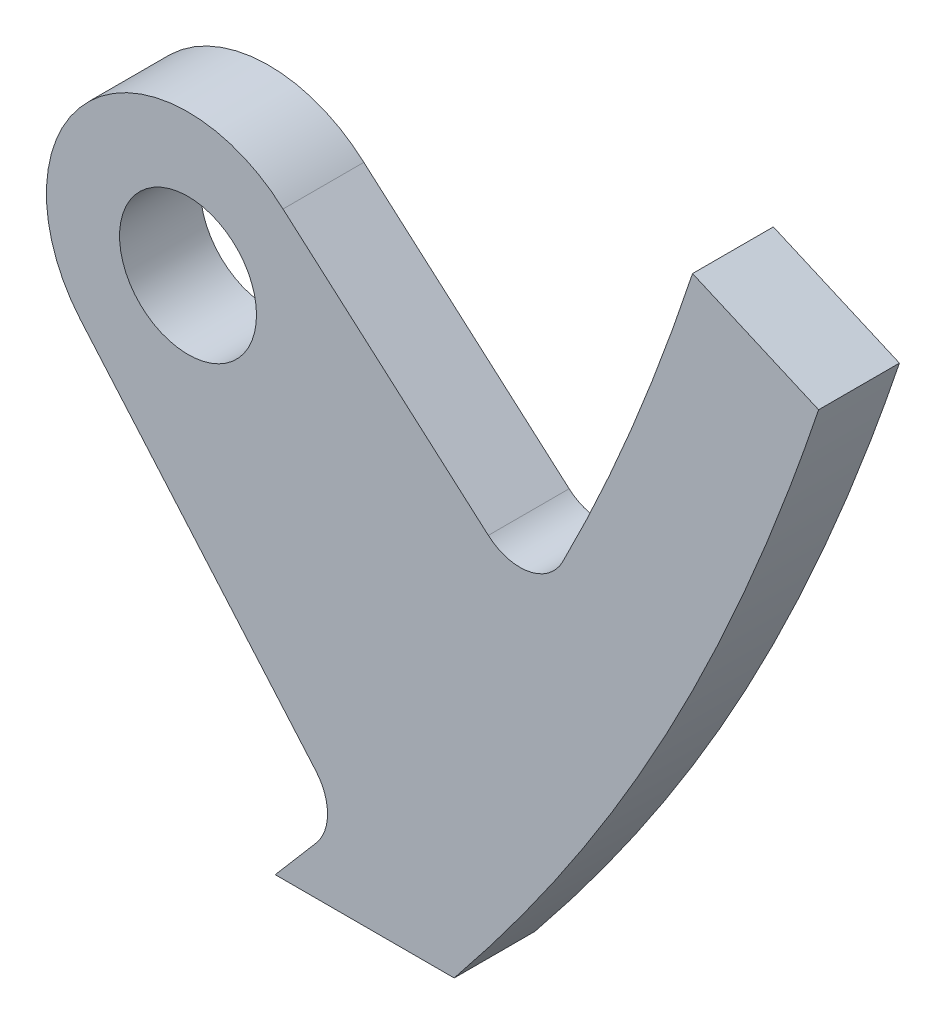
from build123d import *

# Parameters (mm, degrees)
BOSS_EXTRUDE1_DEPTH = 2.9972
SKETCH3_W           = 2.828248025
SKETCH3_H           = 3.360453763
SKETCH3_W_2         = 2.921266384
SKETCH3_H_2         = 2.7432
CUT_EXTRUDE1_DEPTH  = 2.9972
SKETCH4_R           = 2.54
BOSS_EXTRUDE2_DEPTH = 2.9972
FILLET2_R           = 1.778
CUT_EXTRUDE2_DEPTH  = 7.62


with BuildPart() as part:
    # Sketch2 → Boss-Extrude1 (new body)
    with BuildSketch(Plane.XY):
        with BuildLine():
            Line((-71.122282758, 0.152274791), (-71.122282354, 0))
            Line((-71.122282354, 0), (-76.2, 0))
            add(Edge.make_bspline(
                [(-76.2, 0), (-76.569654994, 12.326423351), (-70.425353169, 26.763478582), (-35.694986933, 54.959288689), (-31.122332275, 88.312292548), (-28.575, 106.68)],
                knots=[0, 0, 0, 0, 0.192928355, 0.526146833, 1, 1, 1, 1], degree=3))
            Line((-28.575, 106.68), (-23.543159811, 106.68))
            Line((-23.543159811, 106.68), (-23.543159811, 105.98215739))
            add(Edge.make_bspline(
                [(-71.122282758, 0.152274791), (-71.136070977, 0.612053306), (-71.156705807, 1.549793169), (-71.164598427, 3.28211812), (-71.116797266, 5.286174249), (-70.973071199, 7.421615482), (-70.676706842, 9.95097976), (-70.130555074, 12.571826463), (-69.245381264, 15.104636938), (-68.120237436, 17.334393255), (-66.672184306, 19.551075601), (-64.863064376, 21.934930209), (-62.11843264, 25.208242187), (-58.137191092, 29.502846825), (-52.85973139, 34.964227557), (-47.448209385, 40.791541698), (-42.251514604, 47.060450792), (-37.691832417, 53.925317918), (-34.064233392, 61.084345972), (-31.169794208, 68.465794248), (-28.900123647, 75.982476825), (-27.122712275, 83.563137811), (-25.715420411, 91.141122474), (-24.75221092, 97.394015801), (-24.048588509, 102.335722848), (-23.712246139, 104.76294926), (-23.543159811, 105.98215739)],
                knots=[0, 0, 0, 0, 0.0078125, 0.015625, 0.03125, 0.046875, 0.0625, 0.09375, 0.125, 0.15625, 0.1875, 0.21875, 0.25, 0.3125, 0.375, 0.4375, 0.5, 0.5625, 0.625, 0.6875, 0.75, 0.8125, 0.875, 0.9375, 0.96875, 1, 1, 1, 1], degree=3))
        make_face()
    extrude(amount=BOSS_EXTRUDE1_DEPTH)

    # Sketch3 → Cut-Extrude1 (cut)
    with BuildSketch(Plane.XY.offset(2.9972)):
        Polygon((-73.66, 0), (-73.66, 2.7432), (-76.239147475, 2.7432), (-76.567195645, 0), align=None)
        Polygon((-70.028476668, 12.7), (-72.729966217, 12.7), (-72.729966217, 9.906), (-70.643031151, 9.906), align=None)
        with Locations((-45.87350761, 42.769773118)):
            Rectangle(SKETCH3_W, SKETCH3_H)
        with Locations((-27.495633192, 105.3084)):
            Rectangle(SKETCH3_W_2, SKETCH3_H_2)
    extrude(amount=-CUT_EXTRUDE1_DEPTH, mode=Mode.SUBTRACT)

    # Sketch4 → Boss-Extrude2 (add)
    with BuildSketch(Plane.XY.offset(2.9972)):
        with BuildLine():
            Line((-58.336130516, 58.681288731), (-47.446006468, 46.053291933))
            Line((-47.446006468, 46.053291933), (-39.030945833, 55.653227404))
            Line((-39.030945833, 55.653227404), (-50.808604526, 65.977225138))
            ThreePointArc((-50.808604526, 65.977225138), (-57.98767719, 65.852976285), (-58.336130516, 58.681288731))
        make_face()
        with Locations((-54.331784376, 62.081037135)):
            Circle(SKETCH4_R, mode=Mode.SUBTRACT)
    extrude(amount=-BOSS_EXTRUDE2_DEPTH)

    # Fillet2
    fillet2_edges = [part.edges().sort_by_distance(p)[0] for p in [
        (-48.608915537, 47.401780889, 1.4986),
        (-41.504870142, 57.821806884, 1.4986),
    ]]
    fillet(fillet2_edges, radius=FILLET2_R)

    # Sketch5 → Cut-Extrude2 (cut)
    with BuildSketch(Plane.XY.offset(2.9972)):
        Polygon((-47.287631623, 44.45), (-83.370937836, 44.45), (-83.370937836, -3.941183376), (-3.366229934, -3.941183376), (-3.366229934, 110.917060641), (-43.368583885, 110.917060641), (-43.368583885, 74.875335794), (-23.36740691, 66.161951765), (-23.36740691, 44.45), align=None)
    extrude(amount=-CUT_EXTRUDE2_DEPTH, mode=Mode.SUBTRACT)


solid = part.part
